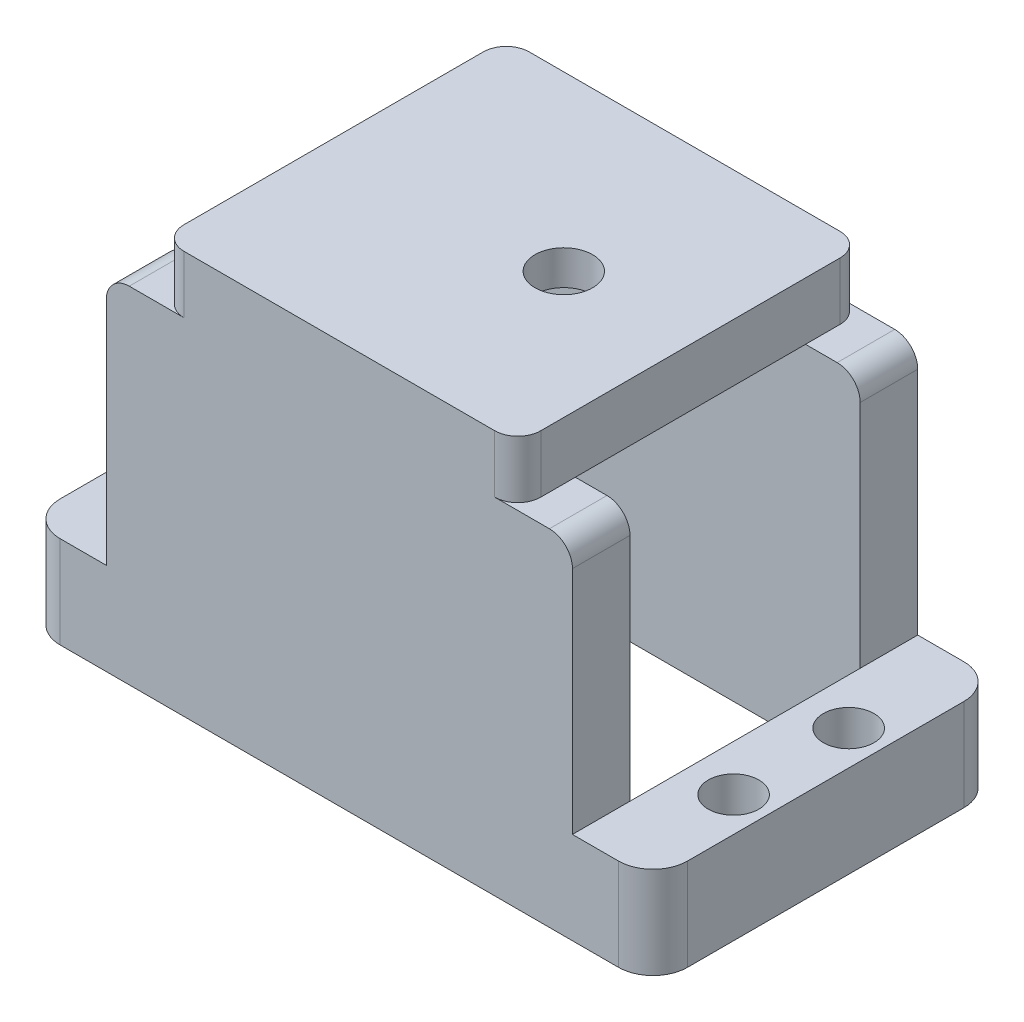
ISO-10303-21;
HEADER;
FILE_DESCRIPTION(('STEP AP214'),'2;1');
FILE_NAME('part.step','',(''),(''),'','','');
FILE_SCHEMA(('AUTOMOTIVE_DESIGN { 1 0 10303 214 1 1 1 1 }'));
ENDSEC;
DATA;
#1=APPLICATION_CONTEXT('core data for automotive mechanical design processes');
#2=APPLICATION_PROTOCOL_DEFINITION('international standard','automotive_design',2000,#1);
#3=PRODUCT_CONTEXT('',#1,'mechanical');
#4=PRODUCT('Part','Part','',(#3));
#5=PRODUCT_RELATED_PRODUCT_CATEGORY('part','',(#4));
#6=PRODUCT_DEFINITION_FORMATION('','',#4);
#7=PRODUCT_DEFINITION_CONTEXT('part definition',#1,'design');
#8=PRODUCT_DEFINITION('design','',#6,#7);
#9=PRODUCT_DEFINITION_SHAPE('','',#8);
#10=(LENGTH_UNIT() NAMED_UNIT(*) SI_UNIT(.MILLI.,.METRE.));
#11=(NAMED_UNIT(*) PLANE_ANGLE_UNIT() SI_UNIT($,.RADIAN.));
#12=(NAMED_UNIT(*) SI_UNIT($,.STERADIAN.) SOLID_ANGLE_UNIT());
#13=UNCERTAINTY_MEASURE_WITH_UNIT(LENGTH_MEASURE(1.E-05),#10,'distance_accuracy_value','');
#14=(GEOMETRIC_REPRESENTATION_CONTEXT(3) GLOBAL_UNCERTAINTY_ASSIGNED_CONTEXT((#13)) GLOBAL_UNIT_ASSIGNED_CONTEXT((#10,
#11,#12)) REPRESENTATION_CONTEXT('',''));
#15=CARTESIAN_POINT('',(0.,0.,0.));
#16=DIRECTION('',(0.,0.,1.));
#17=DIRECTION('',(1.,0.,0.));
#18=AXIS2_PLACEMENT_3D('',#15,#16,#17);
#19=CARTESIAN_POINT('',(31.75,0.,15.));
#20=DIRECTION('',(0.,1.,0.));
#21=DIRECTION('',(0.,0.,1.));
#22=AXIS2_PLACEMENT_3D('',#19,#20,#21);
#23=CYLINDRICAL_SURFACE('',#22,2.50006622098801);
#24=CARTESIAN_POINT('',(31.75,35.,15.));
#25=DIRECTION('',(0.,1.,0.));
#26=DIRECTION('',(0.,0.,1.));
#27=AXIS2_PLACEMENT_3D('',#24,#25,#26);
#28=CIRCLE('',#27,2.50006622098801);
#29=CARTESIAN_POINT('',(31.75,35.,17.500066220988));
#30=VERTEX_POINT('',#29);
#31=EDGE_CURVE('E355',#30,#30,#28,.T.);
#32=ORIENTED_EDGE('',*,*,#31,.T.);
#33=EDGE_LOOP('',(#32));
#34=FACE_BOUND('',#33,.T.);
#35=CARTESIAN_POINT('',(31.75,32.,15.));
#36=DIRECTION('',(0.,-1.,0.));
#37=DIRECTION('',(0.,0.,-1.));
#38=AXIS2_PLACEMENT_3D('',#35,#36,#37);
#39=CIRCLE('',#38,2.50006622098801);
#40=CARTESIAN_POINT('',(31.75,32.,12.499933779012));
#41=VERTEX_POINT('',#40);
#42=EDGE_CURVE('E352',#41,#41,#39,.F.);
#43=ORIENTED_EDGE('',*,*,#42,.F.);
#44=EDGE_LOOP('',(#43));
#45=FACE_BOUND('',#44,.T.);
#46=ADVANCED_FACE('F44',(#34,#45),#23,.F.);
#47=CARTESIAN_POINT('',(0.,30.,0.));
#48=DIRECTION('',(0.,1.,0.));
#49=DIRECTION('',(0.,0.,1.));
#50=AXIS2_PLACEMENT_3D('',#47,#48,#49);
#51=PLANE('',#50);
#52=DIRECTION('',(-1.,0.,0.));
#53=VECTOR('',#52,1.);
#54=CARTESIAN_POINT('',(7.,30.,25.));
#55=LINE('',#54,#53);
#56=CARTESIAN_POINT('',(11.75,30.,25.));
#57=VERTEX_POINT('',#56);
#58=CARTESIAN_POINT('',(9.,30.,25.));
#59=VERTEX_POINT('',#58);
#60=EDGE_CURVE('E267',#57,#59,#55,.T.);
#61=ORIENTED_EDGE('',*,*,#60,.T.);
#62=DIRECTION('',(0.,0.,1.));
#63=VECTOR('',#62,1.);
#64=CARTESIAN_POINT('',(9.,30.,30.));
#65=LINE('',#64,#63);
#66=CARTESIAN_POINT('',(9.,30.,30.));
#67=VERTEX_POINT('',#66);
#68=EDGE_CURVE('E480',#59,#67,#65,.T.);
#69=ORIENTED_EDGE('',*,*,#68,.T.);
#70=DIRECTION('',(1.,0.,0.));
#71=VECTOR('',#70,1.);
#72=CARTESIAN_POINT('',(0.,30.,30.));
#73=LINE('',#72,#71);
#74=CARTESIAN_POINT('',(13.75,30.,30.));
#75=VERTEX_POINT('',#74);
#76=EDGE_CURVE('E319',#67,#75,#73,.T.);
#77=ORIENTED_EDGE('',*,*,#76,.T.);
#78=CARTESIAN_POINT('',(13.75,30.,28.));
#79=DIRECTION('',(0.,1.,0.));
#80=DIRECTION('',(0.,0.,1.));
#81=AXIS2_PLACEMENT_3D('',#78,#79,#80);
#82=CIRCLE('',#81,2.);
#83=CARTESIAN_POINT('',(11.75,30.,28.));
#84=VERTEX_POINT('',#83);
#85=EDGE_CURVE('E11',#75,#84,#82,.F.);
#86=ORIENTED_EDGE('',*,*,#85,.T.);
#87=DIRECTION('',(0.,0.,1.));
#88=VECTOR('',#87,1.);
#89=CARTESIAN_POINT('',(11.75,30.,0.));
#90=LINE('',#89,#88);
#91=EDGE_CURVE('E302',#57,#84,#90,.T.);
#92=ORIENTED_EDGE('',*,*,#91,.F.);
#93=EDGE_LOOP('',(#61,#69,#77,#86,#92));
#94=FACE_BOUND('',#93,.T.);
#95=ADVANCED_FACE('F569',(#94),#51,.T.);
#96=DIRECTION('',(-1.,0.,0.));
#97=VECTOR('',#96,1.);
#98=CARTESIAN_POINT('',(0.,30.,0.));
#99=LINE('',#98,#97);
#100=CARTESIAN_POINT('',(13.75,30.,0.));
#101=VERTEX_POINT('',#100);
#102=CARTESIAN_POINT('',(9.,30.,0.));
#103=VERTEX_POINT('',#102);
#104=EDGE_CURVE('E312',#101,#103,#99,.T.);
#105=ORIENTED_EDGE('',*,*,#104,.T.);
#106=DIRECTION('',(0.,0.,1.));
#107=VECTOR('',#106,1.);
#108=CARTESIAN_POINT('',(9.,30.,5.));
#109=LINE('',#108,#107);
#110=CARTESIAN_POINT('',(9.,30.,5.));
#111=VERTEX_POINT('',#110);
#112=EDGE_CURVE('E486',#103,#111,#109,.T.);
#113=ORIENTED_EDGE('',*,*,#112,.T.);
#114=DIRECTION('',(1.,0.,0.));
#115=VECTOR('',#114,1.);
#116=CARTESIAN_POINT('',(7.,30.,5.));
#117=LINE('',#116,#115);
#118=CARTESIAN_POINT('',(11.75,30.,5.));
#119=VERTEX_POINT('',#118);
#120=EDGE_CURVE('E864',#111,#119,#117,.T.);
#121=ORIENTED_EDGE('',*,*,#120,.T.);
#122=CARTESIAN_POINT('',(11.75,30.,2.));
#123=VERTEX_POINT('',#122);
#124=EDGE_CURVE('E297',#123,#119,#90,.T.);
#125=ORIENTED_EDGE('',*,*,#124,.F.);
#126=CARTESIAN_POINT('',(13.75,30.,2.));
#127=DIRECTION('',(0.,1.,0.));
#128=DIRECTION('',(0.,0.,1.));
#129=AXIS2_PLACEMENT_3D('',#126,#127,#128);
#130=CIRCLE('',#129,2.);
#131=EDGE_CURVE('E53',#123,#101,#130,.F.);
#132=ORIENTED_EDGE('',*,*,#131,.T.);
#133=EDGE_LOOP('',(#105,#113,#121,#125,#132));
#134=FACE_BOUND('',#133,.T.);
#135=ADVANCED_FACE('F503',(#134),#51,.T.);
#136=CARTESIAN_POINT('',(40.75,30.,30.));
#137=VERTEX_POINT('',#136);
#138=CARTESIAN_POINT('',(45.5,30.,30.));
#139=VERTEX_POINT('',#138);
#140=EDGE_CURVE('E340',#137,#139,#73,.T.);
#141=ORIENTED_EDGE('',*,*,#140,.T.);
#142=DIRECTION('',(0.,0.,1.));
#143=VECTOR('',#142,1.);
#144=CARTESIAN_POINT('',(45.5,30.,25.));
#145=LINE('',#144,#143);
#146=CARTESIAN_POINT('',(45.5,30.,25.));
#147=VERTEX_POINT('',#146);
#148=EDGE_CURVE('E262',#139,#147,#145,.F.);
#149=ORIENTED_EDGE('',*,*,#148,.T.);
#150=CARTESIAN_POINT('',(42.75,30.,25.));
#151=VERTEX_POINT('',#150);
#152=EDGE_CURVE('E255',#147,#151,#55,.T.);
#153=ORIENTED_EDGE('',*,*,#152,.T.);
#154=DIRECTION('',(0.,0.,-1.));
#155=VECTOR('',#154,1.);
#156=CARTESIAN_POINT('',(42.75,30.,0.));
#157=LINE('',#156,#155);
#158=CARTESIAN_POINT('',(42.75,30.,28.));
#159=VERTEX_POINT('',#158);
#160=EDGE_CURVE('E260',#159,#151,#157,.T.);
#161=ORIENTED_EDGE('',*,*,#160,.F.);
#162=CARTESIAN_POINT('',(40.75,30.,28.));
#163=DIRECTION('',(0.,1.,0.));
#164=DIRECTION('',(0.,0.,1.));
#165=AXIS2_PLACEMENT_3D('',#162,#163,#164);
#166=CIRCLE('',#165,2.);
#167=EDGE_CURVE('E493',#159,#137,#166,.F.);
#168=ORIENTED_EDGE('',*,*,#167,.T.);
#169=EDGE_LOOP('',(#141,#149,#153,#161,#168));
#170=FACE_BOUND('',#169,.T.);
#171=ADVANCED_FACE('F258',(#170),#51,.T.);
#172=CARTESIAN_POINT('',(7.,30.,0.));
#173=DIRECTION('',(1.,0.,0.));
#174=DIRECTION('',(0.,1.,0.));
#175=AXIS2_PLACEMENT_3D('',#172,#173,#174);
#176=PLANE('',#175);
#177=DIRECTION('',(0.,1.,0.));
#178=VECTOR('',#177,1.);
#179=CARTESIAN_POINT('',(7.,30.,30.));
#180=LINE('',#179,#178);
#181=CARTESIAN_POINT('',(7.,8.,30.));
#182=VERTEX_POINT('',#181);
#183=CARTESIAN_POINT('',(7.,28.,30.));
#184=VERTEX_POINT('',#183);
#185=EDGE_CURVE('E765',#182,#184,#180,.T.);
#186=ORIENTED_EDGE('',*,*,#185,.T.);
#187=DIRECTION('',(0.,0.,1.));
#188=VECTOR('',#187,1.);
#189=CARTESIAN_POINT('',(7.,28.,25.));
#190=LINE('',#189,#188);
#191=CARTESIAN_POINT('',(7.,28.,25.));
#192=VERTEX_POINT('',#191);
#193=EDGE_CURVE('E68',#184,#192,#190,.F.);
#194=ORIENTED_EDGE('',*,*,#193,.T.);
#195=DIRECTION('',(0.,-1.,0.));
#196=VECTOR('',#195,1.);
#197=CARTESIAN_POINT('',(7.,30.,25.));
#198=LINE('',#197,#196);
#199=CARTESIAN_POINT('',(7.,8.,25.));
#200=VERTEX_POINT('',#199);
#201=EDGE_CURVE('E720',#192,#200,#198,.T.);
#202=ORIENTED_EDGE('',*,*,#201,.T.);
#203=DIRECTION('',(0.,0.,1.));
#204=VECTOR('',#203,1.);
#205=CARTESIAN_POINT('',(7.,8.,0.));
#206=LINE('',#205,#204);
#207=EDGE_CURVE('E764',#200,#182,#206,.T.);
#208=ORIENTED_EDGE('',*,*,#207,.T.);
#209=EDGE_LOOP('',(#186,#194,#202,#208));
#210=FACE_BOUND('',#209,.T.);
#211=ADVANCED_FACE('F618',(#210),#176,.F.);
#212=CARTESIAN_POINT('',(47.5,30.,0.));
#213=DIRECTION('',(-1.,0.,0.));
#214=DIRECTION('',(0.,0.,1.));
#215=AXIS2_PLACEMENT_3D('',#212,#213,#214);
#216=PLANE('',#215);
#217=DIRECTION('',(0.,-1.,0.));
#218=VECTOR('',#217,1.);
#219=CARTESIAN_POINT('',(47.5,30.,25.));
#220=LINE('',#219,#218);
#221=CARTESIAN_POINT('',(47.5,28.,25.));
#222=VERTEX_POINT('',#221);
#223=CARTESIAN_POINT('',(47.5,8.,25.));
#224=VERTEX_POINT('',#223);
#225=EDGE_CURVE('E706',#222,#224,#220,.T.);
#226=ORIENTED_EDGE('',*,*,#225,.F.);
#227=DIRECTION('',(0.,0.,1.));
#228=VECTOR('',#227,1.);
#229=CARTESIAN_POINT('',(47.5,28.,30.));
#230=LINE('',#229,#228);
#231=CARTESIAN_POINT('',(47.5,28.,30.));
#232=VERTEX_POINT('',#231);
#233=EDGE_CURVE('E469',#222,#232,#230,.T.);
#234=ORIENTED_EDGE('',*,*,#233,.T.);
#235=DIRECTION('',(0.,-1.,0.));
#236=VECTOR('',#235,1.);
#237=CARTESIAN_POINT('',(47.5,30.,30.));
#238=LINE('',#237,#236);
#239=CARTESIAN_POINT('',(47.5,8.,30.));
#240=VERTEX_POINT('',#239);
#241=EDGE_CURVE('E739',#232,#240,#238,.T.);
#242=ORIENTED_EDGE('',*,*,#241,.T.);
#243=DIRECTION('',(0.,0.,1.));
#244=VECTOR('',#243,1.);
#245=CARTESIAN_POINT('',(47.5,8.,0.));
#246=LINE('',#245,#244);
#247=EDGE_CURVE('E712',#224,#240,#246,.T.);
#248=ORIENTED_EDGE('',*,*,#247,.F.);
#249=EDGE_LOOP('',(#226,#234,#242,#248));
#250=FACE_BOUND('',#249,.T.);
#251=ADVANCED_FACE('F609',(#250),#216,.F.);
#252=CARTESIAN_POINT('',(42.75,30.,5.));
#253=VERTEX_POINT('',#252);
#254=CARTESIAN_POINT('',(45.5,30.,5.));
#255=VERTEX_POINT('',#254);
#256=EDGE_CURVE('E861',#253,#255,#117,.T.);
#257=ORIENTED_EDGE('',*,*,#256,.T.);
#258=DIRECTION('',(0.,0.,1.));
#259=VECTOR('',#258,1.);
#260=CARTESIAN_POINT('',(45.5,30.,0.));
#261=LINE('',#260,#259);
#262=CARTESIAN_POINT('',(45.5,30.,0.));
#263=VERTEX_POINT('',#262);
#264=EDGE_CURVE('E466',#255,#263,#261,.F.);
#265=ORIENTED_EDGE('',*,*,#264,.T.);
#266=CARTESIAN_POINT('',(40.75,30.,0.));
#267=VERTEX_POINT('',#266);
#268=EDGE_CURVE('E306',#263,#267,#99,.T.);
#269=ORIENTED_EDGE('',*,*,#268,.T.);
#270=CARTESIAN_POINT('',(40.75,30.,2.));
#271=DIRECTION('',(0.,1.,0.));
#272=DIRECTION('',(0.,0.,1.));
#273=AXIS2_PLACEMENT_3D('',#270,#271,#272);
#274=CIRCLE('',#273,2.);
#275=CARTESIAN_POINT('',(42.75,30.,2.));
#276=VERTEX_POINT('',#275);
#277=EDGE_CURVE('E496',#267,#276,#274,.F.);
#278=ORIENTED_EDGE('',*,*,#277,.T.);
#279=EDGE_CURVE('E283',#253,#276,#157,.T.);
#280=ORIENTED_EDGE('',*,*,#279,.F.);
#281=EDGE_LOOP('',(#257,#265,#269,#278,#280));
#282=FACE_BOUND('',#281,.T.);
#283=ADVANCED_FACE('F578',(#282),#51,.T.);
#284=CARTESIAN_POINT('',(0.,0.,0.));
#285=DIRECTION('',(0.,1.,0.));
#286=DIRECTION('',(0.,0.,1.));
#287=AXIS2_PLACEMENT_3D('',#284,#285,#286);
#288=PLANE('',#287);
#289=DIRECTION('',(1.,0.,0.));
#290=VECTOR('',#289,1.);
#291=CARTESIAN_POINT('',(7.,0.,5.));
#292=LINE('',#291,#290);
#293=CARTESIAN_POINT('',(7.,0.,5.));
#294=VERTEX_POINT('',#293);
#295=CARTESIAN_POINT('',(47.5,0.,5.));
#296=VERTEX_POINT('',#295);
#297=EDGE_CURVE('E858',#294,#296,#292,.T.);
#298=ORIENTED_EDGE('',*,*,#297,.F.);
#299=DIRECTION('',(0.,0.,-1.));
#300=VECTOR('',#299,1.);
#301=CARTESIAN_POINT('',(7.,0.,25.));
#302=LINE('',#301,#300);
#303=CARTESIAN_POINT('',(7.,0.,25.));
#304=VERTEX_POINT('',#303);
#305=EDGE_CURVE('E290',#304,#294,#302,.T.);
#306=ORIENTED_EDGE('',*,*,#305,.F.);
#307=DIRECTION('',(-1.,0.,0.));
#308=VECTOR('',#307,1.);
#309=CARTESIAN_POINT('',(7.,0.,25.));
#310=LINE('',#309,#308);
#311=CARTESIAN_POINT('',(47.5,0.,25.));
#312=VERTEX_POINT('',#311);
#313=EDGE_CURVE('E823',#312,#304,#310,.T.);
#314=ORIENTED_EDGE('',*,*,#313,.F.);
#315=DIRECTION('',(0.,0.,1.));
#316=VECTOR('',#315,1.);
#317=CARTESIAN_POINT('',(47.5,0.,25.));
#318=LINE('',#317,#316);
#319=EDGE_CURVE('E855',#296,#312,#318,.T.);
#320=ORIENTED_EDGE('',*,*,#319,.F.);
#321=EDGE_LOOP('',(#298,#306,#314,#320));
#322=FACE_BOUND('',#321,.T.);
#323=DIRECTION('',(0.,0.,1.));
#324=VECTOR('',#323,1.);
#325=CARTESIAN_POINT('',(0.,0.,0.));
#326=LINE('',#325,#324);
#327=CARTESIAN_POINT('',(0.,0.,3.));
#328=VERTEX_POINT('',#327);
#329=CARTESIAN_POINT('',(0.,0.,27.));
#330=VERTEX_POINT('',#329);
#331=EDGE_CURVE('E323',#328,#330,#326,.T.);
#332=ORIENTED_EDGE('',*,*,#331,.F.);
#333=CARTESIAN_POINT('',(3.,0.,3.));
#334=DIRECTION('',(0.,1.,0.));
#335=DIRECTION('',(0.,0.,1.));
#336=AXIS2_PLACEMENT_3D('',#333,#334,#335);
#337=CIRCLE('',#336,3.);
#338=CARTESIAN_POINT('',(3.,0.,0.));
#339=VERTEX_POINT('',#338);
#340=EDGE_CURVE('E370',#328,#339,#337,.F.);
#341=ORIENTED_EDGE('',*,*,#340,.T.);
#342=DIRECTION('',(-1.,0.,0.));
#343=VECTOR('',#342,1.);
#344=CARTESIAN_POINT('',(0.,0.,0.));
#345=LINE('',#344,#343);
#346=CARTESIAN_POINT('',(51.5,0.,0.));
#347=VERTEX_POINT('',#346);
#348=EDGE_CURVE('E336',#347,#339,#345,.T.);
#349=ORIENTED_EDGE('',*,*,#348,.F.);
#350=CARTESIAN_POINT('',(51.5,0.,3.));
#351=DIRECTION('',(0.,1.,0.));
#352=DIRECTION('',(0.,0.,1.));
#353=AXIS2_PLACEMENT_3D('',#350,#351,#352);
#354=CIRCLE('',#353,3.);
#355=CARTESIAN_POINT('',(54.5,0.,3.));
#356=VERTEX_POINT('',#355);
#357=EDGE_CURVE('E364',#347,#356,#354,.F.);
#358=ORIENTED_EDGE('',*,*,#357,.T.);
#359=DIRECTION('',(0.,0.,-1.));
#360=VECTOR('',#359,1.);
#361=CARTESIAN_POINT('',(54.5,0.,0.));
#362=LINE('',#361,#360);
#363=CARTESIAN_POINT('',(54.5,0.,27.));
#364=VERTEX_POINT('',#363);
#365=EDGE_CURVE('E332',#364,#356,#362,.T.);
#366=ORIENTED_EDGE('',*,*,#365,.F.);
#367=CARTESIAN_POINT('',(51.5,0.,27.));
#368=DIRECTION('',(0.,1.,0.));
#369=DIRECTION('',(0.,0.,1.));
#370=AXIS2_PLACEMENT_3D('',#367,#368,#369);
#371=CIRCLE('',#370,3.);
#372=CARTESIAN_POINT('',(51.5,0.,30.));
#373=VERTEX_POINT('',#372);
#374=EDGE_CURVE('E361',#364,#373,#371,.F.);
#375=ORIENTED_EDGE('',*,*,#374,.T.);
#376=DIRECTION('',(1.,0.,0.));
#377=VECTOR('',#376,1.);
#378=CARTESIAN_POINT('',(0.,0.,30.));
#379=LINE('',#378,#377);
#380=CARTESIAN_POINT('',(3.,0.,30.));
#381=VERTEX_POINT('',#380);
#382=EDGE_CURVE('E327',#381,#373,#379,.T.);
#383=ORIENTED_EDGE('',*,*,#382,.F.);
#384=CARTESIAN_POINT('',(3.,0.,27.));
#385=DIRECTION('',(0.,1.,0.));
#386=DIRECTION('',(0.,0.,1.));
#387=AXIS2_PLACEMENT_3D('',#384,#385,#386);
#388=CIRCLE('',#387,3.);
#389=EDGE_CURVE('E367',#381,#330,#388,.F.);
#390=ORIENTED_EDGE('',*,*,#389,.T.);
#391=EDGE_LOOP('',(#332,#341,#349,#358,#366,#375,#383,#390));
#392=FACE_BOUND('',#391,.T.);
#393=CARTESIAN_POINT('',(51.5,0.,10.));
#394=DIRECTION('',(0.,1.,0.));
#395=DIRECTION('',(0.,0.,1.));
#396=AXIS2_PLACEMENT_3D('',#393,#394,#395);
#397=CIRCLE('',#396,2.2);
#398=CARTESIAN_POINT('',(51.5,0.,12.2));
#399=VERTEX_POINT('',#398);
#400=EDGE_CURVE('E328',#399,#399,#397,.T.);
#401=ORIENTED_EDGE('',*,*,#400,.T.);
#402=EDGE_LOOP('',(#401));
#403=FACE_BOUND('',#402,.T.);
#404=CARTESIAN_POINT('',(51.5,0.,20.));
#405=DIRECTION('',(0.,1.,0.));
#406=DIRECTION('',(0.,0.,-1.));
#407=AXIS2_PLACEMENT_3D('',#404,#405,#406);
#408=CIRCLE('',#407,2.2);
#409=CARTESIAN_POINT('',(51.5,0.,17.8));
#410=VERTEX_POINT('',#409);
#411=EDGE_CURVE('E790',#410,#410,#408,.T.);
#412=ORIENTED_EDGE('',*,*,#411,.T.);
#413=EDGE_LOOP('',(#412));
#414=FACE_BOUND('',#413,.T.);
#415=CARTESIAN_POINT('',(3.00000000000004,0.,20.));
#416=DIRECTION('',(0.,1.,0.));
#417=DIRECTION('',(0.,0.,1.));
#418=AXIS2_PLACEMENT_3D('',#415,#416,#417);
#419=CIRCLE('',#418,2.2);
#420=CARTESIAN_POINT('',(3.00000000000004,0.,22.2));
#421=VERTEX_POINT('',#420);
#422=EDGE_CURVE('E786',#421,#421,#419,.T.);
#423=ORIENTED_EDGE('',*,*,#422,.T.);
#424=EDGE_LOOP('',(#423));
#425=FACE_BOUND('',#424,.T.);
#426=CARTESIAN_POINT('',(3.00000000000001,0.,10.));
#427=DIRECTION('',(0.,1.,0.));
#428=DIRECTION('',(0.,0.,-1.));
#429=AXIS2_PLACEMENT_3D('',#426,#427,#428);
#430=CIRCLE('',#429,2.2);
#431=CARTESIAN_POINT('',(3.00000000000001,0.,7.80000000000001));
#432=VERTEX_POINT('',#431);
#433=EDGE_CURVE('E782',#432,#432,#430,.T.);
#434=ORIENTED_EDGE('',*,*,#433,.T.);
#435=EDGE_LOOP('',(#434));
#436=FACE_BOUND('',#435,.T.);
#437=ADVANCED_FACE('F635',(#322,#392,#403,#414,#425,#436),#288,.F.);
#438=CARTESIAN_POINT('',(0.,30.,0.));
#439=DIRECTION('',(1.,0.,0.));
#440=DIRECTION('',(0.,0.,-1.));
#441=AXIS2_PLACEMENT_3D('',#438,#439,#440);
#442=PLANE('',#441);
#443=DIRECTION('',(0.,0.,1.));
#444=VECTOR('',#443,1.);
#445=CARTESIAN_POINT('',(0.,8.,0.));
#446=LINE('',#445,#444);
#447=CARTESIAN_POINT('',(0.,8.,3.));
#448=VERTEX_POINT('',#447);
#449=CARTESIAN_POINT('',(0.,8.,27.));
#450=VERTEX_POINT('',#449);
#451=EDGE_CURVE('E754',#448,#450,#446,.T.);
#452=ORIENTED_EDGE('',*,*,#451,.F.);
#453=DIRECTION('',(0.,-1.,0.));
#454=VECTOR('',#453,1.);
#455=CARTESIAN_POINT('',(0.,30.,3.));
#456=LINE('',#455,#454);
#457=EDGE_CURVE('E310',#448,#328,#456,.T.);
#458=ORIENTED_EDGE('',*,*,#457,.T.);
#459=ORIENTED_EDGE('',*,*,#331,.T.);
#460=DIRECTION('',(0.,-1.,0.));
#461=VECTOR('',#460,1.);
#462=CARTESIAN_POINT('',(0.,30.,27.));
#463=LINE('',#462,#461);
#464=EDGE_CURVE('E305',#330,#450,#463,.F.);
#465=ORIENTED_EDGE('',*,*,#464,.T.);
#466=EDGE_LOOP('',(#452,#458,#459,#465));
#467=FACE_BOUND('',#466,.T.);
#468=ADVANCED_FACE('F638',(#467),#442,.F.);
#469=CARTESIAN_POINT('',(0.,30.,30.));
#470=DIRECTION('',(0.,0.,-1.));
#471=DIRECTION('',(-1.,0.,0.));
#472=AXIS2_PLACEMENT_3D('',#469,#470,#471);
#473=PLANE('',#472);
#474=ORIENTED_EDGE('',*,*,#140,.F.);
#475=DIRECTION('',(0.,-1.,0.));
#476=VECTOR('',#475,1.);
#477=CARTESIAN_POINT('',(40.75,30.,30.));
#478=LINE('',#477,#476);
#479=CARTESIAN_POINT('',(40.75,35.,30.));
#480=VERTEX_POINT('',#479);
#481=EDGE_CURVE('E421',#137,#480,#478,.F.);
#482=ORIENTED_EDGE('',*,*,#481,.T.);
#483=DIRECTION('',(1.,0.,0.));
#484=VECTOR('',#483,1.);
#485=CARTESIAN_POINT('',(11.75,35.,30.));
#486=LINE('',#485,#484);
#487=CARTESIAN_POINT('',(13.75,35.,30.));
#488=VERTEX_POINT('',#487);
#489=EDGE_CURVE('E525',#488,#480,#486,.T.);
#490=ORIENTED_EDGE('',*,*,#489,.F.);
#491=DIRECTION('',(0.,-1.,0.));
#492=VECTOR('',#491,1.);
#493=CARTESIAN_POINT('',(13.75,30.,30.));
#494=LINE('',#493,#492);
#495=EDGE_CURVE('E417',#488,#75,#494,.T.);
#496=ORIENTED_EDGE('',*,*,#495,.T.);
#497=ORIENTED_EDGE('',*,*,#76,.F.);
#498=CARTESIAN_POINT('',(9.,28.,30.));
#499=DIRECTION('',(0.,0.,-1.));
#500=DIRECTION('',(-1.,0.,0.));
#501=AXIS2_PLACEMENT_3D('',#498,#499,#500);
#502=CIRCLE('',#501,2.);
#503=EDGE_CURVE('E411',#67,#184,#502,.F.);
#504=ORIENTED_EDGE('',*,*,#503,.T.);
#505=ORIENTED_EDGE('',*,*,#185,.F.);
#506=DIRECTION('',(1.,0.,0.));
#507=VECTOR('',#506,1.);
#508=CARTESIAN_POINT('',(0.,8.,30.));
#509=LINE('',#508,#507);
#510=CARTESIAN_POINT('',(3.,8.,30.));
#511=VERTEX_POINT('',#510);
#512=EDGE_CURVE('E742',#511,#182,#509,.T.);
#513=ORIENTED_EDGE('',*,*,#512,.F.);
#514=DIRECTION('',(0.,-1.,0.));
#515=VECTOR('',#514,1.);
#516=CARTESIAN_POINT('',(3.,30.,30.));
#517=LINE('',#516,#515);
#518=EDGE_CURVE('E389',#511,#381,#517,.T.);
#519=ORIENTED_EDGE('',*,*,#518,.T.);
#520=ORIENTED_EDGE('',*,*,#382,.T.);
#521=DIRECTION('',(0.,-1.,0.));
#522=VECTOR('',#521,1.);
#523=CARTESIAN_POINT('',(51.5,30.,30.));
#524=LINE('',#523,#522);
#525=CARTESIAN_POINT('',(51.5,8.,30.));
#526=VERTEX_POINT('',#525);
#527=EDGE_CURVE('E386',#373,#526,#524,.F.);
#528=ORIENTED_EDGE('',*,*,#527,.T.);
#529=DIRECTION('',(1.,0.,0.));
#530=VECTOR('',#529,1.);
#531=CARTESIAN_POINT('',(54.5,8.,30.));
#532=LINE('',#531,#530);
#533=EDGE_CURVE('E735',#240,#526,#532,.T.);
#534=ORIENTED_EDGE('',*,*,#533,.F.);
#535=ORIENTED_EDGE('',*,*,#241,.F.);
#536=CARTESIAN_POINT('',(45.5,28.,30.));
#537=DIRECTION('',(0.,0.,-1.));
#538=DIRECTION('',(-1.,0.,0.));
#539=AXIS2_PLACEMENT_3D('',#536,#537,#538);
#540=CIRCLE('',#539,2.);
#541=EDGE_CURVE('E414',#232,#139,#540,.F.);
#542=ORIENTED_EDGE('',*,*,#541,.T.);
#543=EDGE_LOOP('',(#474,#482,#490,#496,#497,#504,#505,#513,#519,#520,#528,#534,#535,#542));
#544=FACE_BOUND('',#543,.T.);
#545=ADVANCED_FACE('F645',(#544),#473,.F.);
#546=CARTESIAN_POINT('',(54.5,30.,0.));
#547=DIRECTION('',(-1.,0.,0.));
#548=DIRECTION('',(0.,0.,1.));
#549=AXIS2_PLACEMENT_3D('',#546,#547,#548);
#550=PLANE('',#549);
#551=ORIENTED_EDGE('',*,*,#365,.T.);
#552=DIRECTION('',(0.,-1.,0.));
#553=VECTOR('',#552,1.);
#554=CARTESIAN_POINT('',(54.5,30.,3.));
#555=LINE('',#554,#553);
#556=CARTESIAN_POINT('',(54.5,8.,3.));
#557=VERTEX_POINT('',#556);
#558=EDGE_CURVE('E397',#356,#557,#555,.F.);
#559=ORIENTED_EDGE('',*,*,#558,.T.);
#560=DIRECTION('',(0.,0.,1.));
#561=VECTOR('',#560,1.);
#562=CARTESIAN_POINT('',(54.5,8.,0.));
#563=LINE('',#562,#561);
#564=CARTESIAN_POINT('',(54.5,8.,27.));
#565=VERTEX_POINT('',#564);
#566=EDGE_CURVE('E346',#557,#565,#563,.T.);
#567=ORIENTED_EDGE('',*,*,#566,.T.);
#568=DIRECTION('',(0.,-1.,0.));
#569=VECTOR('',#568,1.);
#570=CARTESIAN_POINT('',(54.5,30.,27.));
#571=LINE('',#570,#569);
#572=EDGE_CURVE('E393',#565,#364,#571,.T.);
#573=ORIENTED_EDGE('',*,*,#572,.T.);
#574=EDGE_LOOP('',(#551,#559,#567,#573));
#575=FACE_BOUND('',#574,.T.);
#576=ADVANCED_FACE('F642',(#575),#550,.F.);
#577=CARTESIAN_POINT('',(0.,30.,0.));
#578=DIRECTION('',(0.,0.,1.));
#579=DIRECTION('',(1.,0.,0.));
#580=AXIS2_PLACEMENT_3D('',#577,#578,#579);
#581=PLANE('',#580);
#582=DIRECTION('',(-1.,0.,0.));
#583=VECTOR('',#582,1.);
#584=CARTESIAN_POINT('',(11.75,35.,0.));
#585=LINE('',#584,#583);
#586=CARTESIAN_POINT('',(40.75,35.,0.));
#587=VERTEX_POINT('',#586);
#588=CARTESIAN_POINT('',(13.75,35.,0.));
#589=VERTEX_POINT('',#588);
#590=EDGE_CURVE('E291',#587,#589,#585,.T.);
#591=ORIENTED_EDGE('',*,*,#590,.F.);
#592=DIRECTION('',(0.,-1.,0.));
#593=VECTOR('',#592,1.);
#594=CARTESIAN_POINT('',(40.75,30.,0.));
#595=LINE('',#594,#593);
#596=EDGE_CURVE('E445',#587,#267,#595,.T.);
#597=ORIENTED_EDGE('',*,*,#596,.T.);
#598=ORIENTED_EDGE('',*,*,#268,.F.);
#599=CARTESIAN_POINT('',(45.5,28.,0.));
#600=DIRECTION('',(0.,0.,1.));
#601=DIRECTION('',(1.,0.,0.));
#602=AXIS2_PLACEMENT_3D('',#599,#600,#601);
#603=CIRCLE('',#602,2.);
#604=CARTESIAN_POINT('',(47.5,28.,0.));
#605=VERTEX_POINT('',#604);
#606=EDGE_CURVE('E439',#263,#605,#603,.F.);
#607=ORIENTED_EDGE('',*,*,#606,.T.);
#608=DIRECTION('',(0.,-1.,0.));
#609=VECTOR('',#608,1.);
#610=CARTESIAN_POINT('',(47.5,30.,0.));
#611=LINE('',#610,#609);
#612=CARTESIAN_POINT('',(47.5,8.,0.));
#613=VERTEX_POINT('',#612);
#614=EDGE_CURVE('E731',#605,#613,#611,.T.);
#615=ORIENTED_EDGE('',*,*,#614,.T.);
#616=DIRECTION('',(1.,0.,0.));
#617=VECTOR('',#616,1.);
#618=CARTESIAN_POINT('',(54.5,8.,0.));
#619=LINE('',#618,#617);
#620=CARTESIAN_POINT('',(51.5,8.,0.));
#621=VERTEX_POINT('',#620);
#622=EDGE_CURVE('E734',#613,#621,#619,.T.);
#623=ORIENTED_EDGE('',*,*,#622,.T.);
#624=DIRECTION('',(0.,-1.,0.));
#625=VECTOR('',#624,1.);
#626=CARTESIAN_POINT('',(51.5,30.,0.));
#627=LINE('',#626,#625);
#628=EDGE_CURVE('E373',#621,#347,#627,.T.);
#629=ORIENTED_EDGE('',*,*,#628,.T.);
#630=ORIENTED_EDGE('',*,*,#348,.T.);
#631=DIRECTION('',(0.,-1.,0.));
#632=VECTOR('',#631,1.);
#633=CARTESIAN_POINT('',(3.,30.,0.));
#634=LINE('',#633,#632);
#635=CARTESIAN_POINT('',(3.,8.,0.));
#636=VERTEX_POINT('',#635);
#637=EDGE_CURVE('E377',#339,#636,#634,.F.);
#638=ORIENTED_EDGE('',*,*,#637,.T.);
#639=DIRECTION('',(1.,0.,0.));
#640=VECTOR('',#639,1.);
#641=CARTESIAN_POINT('',(0.,8.,0.));
#642=LINE('',#641,#640);
#643=CARTESIAN_POINT('',(7.,8.,0.));
#644=VERTEX_POINT('',#643);
#645=EDGE_CURVE('E768',#636,#644,#642,.T.);
#646=ORIENTED_EDGE('',*,*,#645,.T.);
#647=DIRECTION('',(0.,1.,0.));
#648=VECTOR('',#647,1.);
#649=CARTESIAN_POINT('',(7.,30.,0.));
#650=LINE('',#649,#648);
#651=CARTESIAN_POINT('',(7.,28.,0.));
#652=VERTEX_POINT('',#651);
#653=EDGE_CURVE('E758',#644,#652,#650,.T.);
#654=ORIENTED_EDGE('',*,*,#653,.T.);
#655=CARTESIAN_POINT('',(9.,28.,0.));
#656=DIRECTION('',(0.,0.,1.));
#657=DIRECTION('',(1.,0.,0.));
#658=AXIS2_PLACEMENT_3D('',#655,#656,#657);
#659=CIRCLE('',#658,2.);
#660=EDGE_CURVE('E436',#652,#103,#659,.F.);
#661=ORIENTED_EDGE('',*,*,#660,.T.);
#662=ORIENTED_EDGE('',*,*,#104,.F.);
#663=DIRECTION('',(0.,-1.,0.));
#664=VECTOR('',#663,1.);
#665=CARTESIAN_POINT('',(13.75,30.,0.));
#666=LINE('',#665,#664);
#667=EDGE_CURVE('E442',#101,#589,#666,.F.);
#668=ORIENTED_EDGE('',*,*,#667,.T.);
#669=EDGE_LOOP('',(#591,#597,#598,#607,#615,#623,#629,#630,#638,#646,#654,#661,#662,#668));
#670=FACE_BOUND('',#669,.T.);
#671=ADVANCED_FACE('F512',(#670),#581,.F.);
#672=CARTESIAN_POINT('',(51.5,30.,10.));
#673=DIRECTION('',(0.,-1.,0.));
#674=DIRECTION('',(0.,0.,-1.));
#675=AXIS2_PLACEMENT_3D('',#672,#673,#674);
#676=CYLINDRICAL_SURFACE('',#675,2.2);
#677=CARTESIAN_POINT('',(51.5,8.,10.));
#678=DIRECTION('',(0.,-1.,0.));
#679=DIRECTION('',(0.,0.,-1.));
#680=AXIS2_PLACEMENT_3D('',#677,#678,#679);
#681=CIRCLE('',#680,2.2);
#682=CARTESIAN_POINT('',(51.5,8.,7.8));
#683=VERTEX_POINT('',#682);
#684=EDGE_CURVE('E351',#683,#683,#681,.T.);
#685=ORIENTED_EDGE('',*,*,#684,.F.);
#686=EDGE_LOOP('',(#685));
#687=FACE_BOUND('',#686,.T.);
#688=ORIENTED_EDGE('',*,*,#400,.F.);
#689=EDGE_LOOP('',(#688));
#690=FACE_BOUND('',#689,.T.);
#691=ADVANCED_FACE('F629',(#687,#690),#676,.F.);
#692=CARTESIAN_POINT('',(51.5,30.,20.));
#693=DIRECTION('',(0.,-1.,0.));
#694=DIRECTION('',(0.,0.,-1.));
#695=AXIS2_PLACEMENT_3D('',#692,#693,#694);
#696=CYLINDRICAL_SURFACE('',#695,2.2);
#697=CARTESIAN_POINT('',(51.5,8.,20.));
#698=DIRECTION('',(0.,-1.,0.));
#699=DIRECTION('',(0.,0.,-1.));
#700=AXIS2_PLACEMENT_3D('',#697,#698,#699);
#701=CIRCLE('',#700,2.2);
#702=CARTESIAN_POINT('',(51.5,8.,17.8));
#703=VERTEX_POINT('',#702);
#704=EDGE_CURVE('E347',#703,#703,#701,.T.);
#705=ORIENTED_EDGE('',*,*,#704,.F.);
#706=EDGE_LOOP('',(#705));
#707=FACE_BOUND('',#706,.T.);
#708=ORIENTED_EDGE('',*,*,#411,.F.);
#709=EDGE_LOOP('',(#708));
#710=FACE_BOUND('',#709,.T.);
#711=ADVANCED_FACE('F625',(#707,#710),#696,.F.);
#712=CARTESIAN_POINT('',(3.00000000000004,30.,20.));
#713=DIRECTION('',(0.,-1.,0.));
#714=DIRECTION('',(0.,0.,-1.));
#715=AXIS2_PLACEMENT_3D('',#712,#713,#714);
#716=CYLINDRICAL_SURFACE('',#715,2.2);
#717=CARTESIAN_POINT('',(3.00000000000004,8.,20.));
#718=DIRECTION('',(0.,-1.,0.));
#719=DIRECTION('',(0.,0.,-1.));
#720=AXIS2_PLACEMENT_3D('',#717,#718,#719);
#721=CIRCLE('',#720,2.2);
#722=CARTESIAN_POINT('',(3.00000000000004,8.,17.8));
#723=VERTEX_POINT('',#722);
#724=EDGE_CURVE('E345',#723,#723,#721,.T.);
#725=ORIENTED_EDGE('',*,*,#724,.F.);
#726=EDGE_LOOP('',(#725));
#727=FACE_BOUND('',#726,.T.);
#728=ORIENTED_EDGE('',*,*,#422,.F.);
#729=EDGE_LOOP('',(#728));
#730=FACE_BOUND('',#729,.T.);
#731=ADVANCED_FACE('F621',(#727,#730),#716,.F.);
#732=CARTESIAN_POINT('',(3.00000000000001,30.,10.));
#733=DIRECTION('',(0.,-1.,0.));
#734=DIRECTION('',(0.,0.,-1.));
#735=AXIS2_PLACEMENT_3D('',#732,#733,#734);
#736=CYLINDRICAL_SURFACE('',#735,2.2);
#737=CARTESIAN_POINT('',(3.00000000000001,8.,10.));
#738=DIRECTION('',(0.,-1.,0.));
#739=DIRECTION('',(0.,0.,-1.));
#740=AXIS2_PLACEMENT_3D('',#737,#738,#739);
#741=CIRCLE('',#740,2.2);
#742=CARTESIAN_POINT('',(3.00000000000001,8.,7.80000000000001));
#743=VERTEX_POINT('',#742);
#744=EDGE_CURVE('E341',#743,#743,#741,.T.);
#745=ORIENTED_EDGE('',*,*,#744,.F.);
#746=EDGE_LOOP('',(#745));
#747=FACE_BOUND('',#746,.T.);
#748=ORIENTED_EDGE('',*,*,#433,.F.);
#749=EDGE_LOOP('',(#748));
#750=FACE_BOUND('',#749,.T.);
#751=ADVANCED_FACE('F616',(#747,#750),#736,.F.);
#752=DIRECTION('',(0.,-1.,0.));
#753=VECTOR('',#752,1.);
#754=CARTESIAN_POINT('',(7.,30.,5.));
#755=LINE('',#754,#753);
#756=CARTESIAN_POINT('',(7.,28.,5.));
#757=VERTEX_POINT('',#756);
#758=CARTESIAN_POINT('',(7.,8.,5.));
#759=VERTEX_POINT('',#758);
#760=EDGE_CURVE('E728',#757,#759,#755,.T.);
#761=ORIENTED_EDGE('',*,*,#760,.F.);
#762=DIRECTION('',(0.,0.,1.));
#763=VECTOR('',#762,1.);
#764=CARTESIAN_POINT('',(7.,28.,0.));
#765=LINE('',#764,#763);
#766=EDGE_CURVE('E490',#757,#652,#765,.F.);
#767=ORIENTED_EDGE('',*,*,#766,.T.);
#768=ORIENTED_EDGE('',*,*,#653,.F.);
#769=EDGE_CURVE('E759',#644,#759,#206,.T.);
#770=ORIENTED_EDGE('',*,*,#769,.T.);
#771=EDGE_LOOP('',(#761,#767,#768,#770));
#772=FACE_BOUND('',#771,.T.);
#773=ADVANCED_FACE('F612',(#772),#176,.F.);
#774=CARTESIAN_POINT('',(0.,8.,0.));
#775=DIRECTION('',(0.,-1.,0.));
#776=DIRECTION('',(0.,0.,-1.));
#777=AXIS2_PLACEMENT_3D('',#774,#775,#776);
#778=PLANE('',#777);
#779=ORIENTED_EDGE('',*,*,#724,.T.);
#780=EDGE_LOOP('',(#779));
#781=FACE_BOUND('',#780,.T.);
#782=ORIENTED_EDGE('',*,*,#744,.T.);
#783=EDGE_LOOP('',(#782));
#784=FACE_BOUND('',#783,.T.);
#785=ORIENTED_EDGE('',*,*,#645,.F.);
#786=CARTESIAN_POINT('',(3.,8.,3.));
#787=DIRECTION('',(0.,-1.,0.));
#788=DIRECTION('',(0.,0.,-1.));
#789=AXIS2_PLACEMENT_3D('',#786,#787,#788);
#790=CIRCLE('',#789,3.);
#791=EDGE_CURVE('E383',#636,#448,#790,.F.);
#792=ORIENTED_EDGE('',*,*,#791,.T.);
#793=ORIENTED_EDGE('',*,*,#451,.T.);
#794=CARTESIAN_POINT('',(3.,8.,27.));
#795=DIRECTION('',(0.,-1.,0.));
#796=DIRECTION('',(0.,0.,-1.));
#797=AXIS2_PLACEMENT_3D('',#794,#795,#796);
#798=CIRCLE('',#797,3.);
#799=EDGE_CURVE('E380',#450,#511,#798,.F.);
#800=ORIENTED_EDGE('',*,*,#799,.T.);
#801=ORIENTED_EDGE('',*,*,#512,.T.);
#802=ORIENTED_EDGE('',*,*,#207,.F.);
#803=EDGE_CURVE('E763',#759,#200,#206,.T.);
#804=ORIENTED_EDGE('',*,*,#803,.F.);
#805=ORIENTED_EDGE('',*,*,#769,.F.);
#806=EDGE_LOOP('',(#785,#792,#793,#800,#801,#802,#804,#805));
#807=FACE_BOUND('',#806,.T.);
#808=ADVANCED_FACE('F604',(#781,#784,#807),#778,.F.);
#809=CARTESIAN_POINT('',(54.5,8.,0.));
#810=DIRECTION('',(0.,-1.,0.));
#811=DIRECTION('',(0.,0.,-1.));
#812=AXIS2_PLACEMENT_3D('',#809,#810,#811);
#813=PLANE('',#812);
#814=ORIENTED_EDGE('',*,*,#684,.T.);
#815=EDGE_LOOP('',(#814));
#816=FACE_BOUND('',#815,.T.);
#817=ORIENTED_EDGE('',*,*,#704,.T.);
#818=EDGE_LOOP('',(#817));
#819=FACE_BOUND('',#818,.T.);
#820=ORIENTED_EDGE('',*,*,#566,.F.);
#821=CARTESIAN_POINT('',(51.5,8.,3.));
#822=DIRECTION('',(0.,-1.,0.));
#823=DIRECTION('',(0.,0.,-1.));
#824=AXIS2_PLACEMENT_3D('',#821,#822,#823);
#825=CIRCLE('',#824,3.);
#826=EDGE_CURVE('E403',#557,#621,#825,.F.);
#827=ORIENTED_EDGE('',*,*,#826,.T.);
#828=ORIENTED_EDGE('',*,*,#622,.F.);
#829=CARTESIAN_POINT('',(47.5,8.,5.));
#830=VERTEX_POINT('',#829);
#831=EDGE_CURVE('E749',#613,#830,#246,.T.);
#832=ORIENTED_EDGE('',*,*,#831,.T.);
#833=EDGE_CURVE('E753',#830,#224,#246,.T.);
#834=ORIENTED_EDGE('',*,*,#833,.T.);
#835=ORIENTED_EDGE('',*,*,#247,.T.);
#836=ORIENTED_EDGE('',*,*,#533,.T.);
#837=CARTESIAN_POINT('',(51.5,8.,27.));
#838=DIRECTION('',(0.,-1.,0.));
#839=DIRECTION('',(0.,0.,-1.));
#840=AXIS2_PLACEMENT_3D('',#837,#838,#839);
#841=CIRCLE('',#840,3.);
#842=EDGE_CURVE('E400',#526,#565,#841,.F.);
#843=ORIENTED_EDGE('',*,*,#842,.T.);
#844=EDGE_LOOP('',(#820,#827,#828,#832,#834,#835,#836,#843));
#845=FACE_BOUND('',#844,.T.);
#846=ADVANCED_FACE('F601',(#816,#819,#845),#813,.F.);
#847=ORIENTED_EDGE('',*,*,#614,.F.);
#848=DIRECTION('',(0.,0.,1.));
#849=VECTOR('',#848,1.);
#850=CARTESIAN_POINT('',(47.5,28.,5.));
#851=LINE('',#850,#849);
#852=CARTESIAN_POINT('',(47.5,28.,5.));
#853=VERTEX_POINT('',#852);
#854=EDGE_CURVE('E456',#605,#853,#851,.T.);
#855=ORIENTED_EDGE('',*,*,#854,.T.);
#856=DIRECTION('',(0.,-1.,0.));
#857=VECTOR('',#856,1.);
#858=CARTESIAN_POINT('',(47.5,30.,5.));
#859=LINE('',#858,#857);
#860=EDGE_CURVE('E722',#853,#830,#859,.T.);
#861=ORIENTED_EDGE('',*,*,#860,.T.);
#862=ORIENTED_EDGE('',*,*,#831,.F.);
#863=EDGE_LOOP('',(#847,#855,#861,#862));
#864=FACE_BOUND('',#863,.T.);
#865=ADVANCED_FACE('F599',(#864),#216,.F.);
#866=CARTESIAN_POINT('',(7.,30.,25.));
#867=DIRECTION('',(-1.,0.,0.));
#868=DIRECTION('',(0.,0.,1.));
#869=AXIS2_PLACEMENT_3D('',#866,#867,#868);
#870=PLANE('',#869);
#871=EDGE_CURVE('E715',#200,#304,#198,.T.);
#872=ORIENTED_EDGE('',*,*,#871,.T.);
#873=ORIENTED_EDGE('',*,*,#305,.T.);
#874=EDGE_CURVE('E266',#759,#294,#755,.T.);
#875=ORIENTED_EDGE('',*,*,#874,.F.);
#876=ORIENTED_EDGE('',*,*,#803,.T.);
#877=EDGE_LOOP('',(#872,#873,#875,#876));
#878=FACE_BOUND('',#877,.T.);
#879=ADVANCED_FACE('F594',(#878),#870,.F.);
#880=CARTESIAN_POINT('',(47.5,30.,25.));
#881=DIRECTION('',(1.,0.,0.));
#882=DIRECTION('',(0.,0.,-1.));
#883=AXIS2_PLACEMENT_3D('',#880,#881,#882);
#884=PLANE('',#883);
#885=EDGE_CURVE('E727',#830,#296,#859,.T.);
#886=ORIENTED_EDGE('',*,*,#885,.T.);
#887=ORIENTED_EDGE('',*,*,#319,.T.);
#888=EDGE_CURVE('E716',#224,#312,#220,.T.);
#889=ORIENTED_EDGE('',*,*,#888,.F.);
#890=ORIENTED_EDGE('',*,*,#833,.F.);
#891=EDGE_LOOP('',(#886,#887,#889,#890));
#892=FACE_BOUND('',#891,.T.);
#893=ADVANCED_FACE('F593',(#892),#884,.F.);
#894=CARTESIAN_POINT('',(7.,30.,25.));
#895=DIRECTION('',(0.,0.,1.));
#896=DIRECTION('',(1.,0.,0.));
#897=AXIS2_PLACEMENT_3D('',#894,#895,#896);
#898=PLANE('',#897);
#899=ORIENTED_EDGE('',*,*,#152,.F.);
#900=CARTESIAN_POINT('',(45.5,28.,25.));
#901=DIRECTION('',(0.,0.,1.));
#902=DIRECTION('',(1.,0.,0.));
#903=AXIS2_PLACEMENT_3D('',#900,#901,#902);
#904=CIRCLE('',#903,2.);
#905=EDGE_CURVE('E477',#147,#222,#904,.F.);
#906=ORIENTED_EDGE('',*,*,#905,.T.);
#907=ORIENTED_EDGE('',*,*,#225,.T.);
#908=ORIENTED_EDGE('',*,*,#888,.T.);
#909=ORIENTED_EDGE('',*,*,#313,.T.);
#910=ORIENTED_EDGE('',*,*,#871,.F.);
#911=ORIENTED_EDGE('',*,*,#201,.F.);
#912=CARTESIAN_POINT('',(9.,28.,25.));
#913=DIRECTION('',(0.,0.,1.));
#914=DIRECTION('',(1.,0.,0.));
#915=AXIS2_PLACEMENT_3D('',#912,#913,#914);
#916=CIRCLE('',#915,2.);
#917=EDGE_CURVE('E60',#192,#59,#916,.F.);
#918=ORIENTED_EDGE('',*,*,#917,.T.);
#919=ORIENTED_EDGE('',*,*,#60,.F.);
#920=EDGE_CURVE('E269',#151,#57,#55,.T.);
#921=ORIENTED_EDGE('',*,*,#920,.F.);
#922=EDGE_LOOP('',(#899,#906,#907,#908,#909,#910,#911,#918,#919,#921));
#923=FACE_BOUND('',#922,.T.);
#924=ADVANCED_FACE('F285',(#923),#898,.F.);
#925=CARTESIAN_POINT('',(7.,30.,5.));
#926=DIRECTION('',(0.,0.,-1.));
#927=DIRECTION('',(-1.,0.,0.));
#928=AXIS2_PLACEMENT_3D('',#925,#926,#927);
#929=PLANE('',#928);
#930=ORIENTED_EDGE('',*,*,#860,.F.);
#931=CARTESIAN_POINT('',(45.5,28.,5.));
#932=DIRECTION('',(0.,0.,-1.));
#933=DIRECTION('',(-1.,0.,0.));
#934=AXIS2_PLACEMENT_3D('',#931,#932,#933);
#935=CIRCLE('',#934,2.);
#936=EDGE_CURVE('E463',#853,#255,#935,.F.);
#937=ORIENTED_EDGE('',*,*,#936,.T.);
#938=ORIENTED_EDGE('',*,*,#256,.F.);
#939=EDGE_CURVE('E295',#119,#253,#117,.T.);
#940=ORIENTED_EDGE('',*,*,#939,.F.);
#941=ORIENTED_EDGE('',*,*,#120,.F.);
#942=CARTESIAN_POINT('',(9.,28.,5.));
#943=DIRECTION('',(0.,0.,-1.));
#944=DIRECTION('',(-1.,0.,0.));
#945=AXIS2_PLACEMENT_3D('',#942,#943,#944);
#946=CIRCLE('',#945,2.);
#947=EDGE_CURVE('E460',#111,#757,#946,.F.);
#948=ORIENTED_EDGE('',*,*,#947,.T.);
#949=ORIENTED_EDGE('',*,*,#760,.T.);
#950=ORIENTED_EDGE('',*,*,#874,.T.);
#951=ORIENTED_EDGE('',*,*,#297,.T.);
#952=ORIENTED_EDGE('',*,*,#885,.F.);
#953=EDGE_LOOP('',(#930,#937,#938,#940,#941,#948,#949,#950,#951,#952));
#954=FACE_BOUND('',#953,.T.);
#955=ADVANCED_FACE('F555',(#954),#929,.F.);
#956=CARTESIAN_POINT('',(0.,30.,0.));
#957=DIRECTION('',(0.,1.,0.));
#958=DIRECTION('',(0.,0.,1.));
#959=AXIS2_PLACEMENT_3D('',#956,#957,#958);
#960=PLANE('',#959);
#961=CARTESIAN_POINT('',(31.75,30.,15.));
#962=DIRECTION('',(0.,-1.,0.));
#963=DIRECTION('',(0.,0.,-1.));
#964=AXIS2_PLACEMENT_3D('',#961,#962,#963);
#965=CIRCLE('',#964,6.1);
#966=CARTESIAN_POINT('',(31.75,30.,8.9));
#967=VERTEX_POINT('',#966);
#968=EDGE_CURVE('E535',#967,#967,#965,.T.);
#969=ORIENTED_EDGE('',*,*,#968,.F.);
#970=EDGE_LOOP('',(#969));
#971=FACE_BOUND('',#970,.T.);
#972=EDGE_CURVE('E277',#151,#253,#157,.T.);
#973=ORIENTED_EDGE('',*,*,#972,.F.);
#974=ORIENTED_EDGE('',*,*,#920,.T.);
#975=EDGE_CURVE('E300',#119,#57,#90,.T.);
#976=ORIENTED_EDGE('',*,*,#975,.F.);
#977=ORIENTED_EDGE('',*,*,#939,.T.);
#978=EDGE_LOOP('',(#973,#974,#976,#977));
#979=FACE_BOUND('',#978,.T.);
#980=ADVANCED_FACE('F293',(#971,#979),#960,.F.);
#981=CARTESIAN_POINT('',(11.75,35.,0.));
#982=DIRECTION('',(1.,0.,0.));
#983=DIRECTION('',(0.,0.,-1.));
#984=AXIS2_PLACEMENT_3D('',#981,#982,#983);
#985=PLANE('',#984);
#986=DIRECTION('',(0.,0.,1.));
#987=VECTOR('',#986,1.);
#988=CARTESIAN_POINT('',(11.75,35.,0.));
#989=LINE('',#988,#987);
#990=CARTESIAN_POINT('',(11.75,35.,2.));
#991=VERTEX_POINT('',#990);
#992=CARTESIAN_POINT('',(11.75,35.,28.));
#993=VERTEX_POINT('',#992);
#994=EDGE_CURVE('E281',#991,#993,#989,.T.);
#995=ORIENTED_EDGE('',*,*,#994,.F.);
#996=DIRECTION('',(0.,-1.,0.));
#997=VECTOR('',#996,1.);
#998=CARTESIAN_POINT('',(11.75,35.,2.));
#999=LINE('',#998,#997);
#1000=EDGE_CURVE('E452',#991,#123,#999,.T.);
#1001=ORIENTED_EDGE('',*,*,#1000,.T.);
#1002=ORIENTED_EDGE('',*,*,#124,.T.);
#1003=ORIENTED_EDGE('',*,*,#975,.T.);
#1004=ORIENTED_EDGE('',*,*,#91,.T.);
#1005=DIRECTION('',(0.,-1.,0.));
#1006=VECTOR('',#1005,1.);
#1007=CARTESIAN_POINT('',(11.75,35.,28.));
#1008=LINE('',#1007,#1006);
#1009=EDGE_CURVE('E449',#84,#993,#1008,.F.);
#1010=ORIENTED_EDGE('',*,*,#1009,.T.);
#1011=EDGE_LOOP('',(#995,#1001,#1002,#1003,#1004,#1010));
#1012=FACE_BOUND('',#1011,.T.);
#1013=ADVANCED_FACE('F554',(#1012),#985,.F.);
#1014=CARTESIAN_POINT('',(42.75,35.,0.));
#1015=DIRECTION('',(-1.,0.,0.));
#1016=DIRECTION('',(0.,0.,1.));
#1017=AXIS2_PLACEMENT_3D('',#1014,#1015,#1016);
#1018=PLANE('',#1017);
#1019=DIRECTION('',(0.,0.,-1.));
#1020=VECTOR('',#1019,1.);
#1021=CARTESIAN_POINT('',(42.75,35.,0.));
#1022=LINE('',#1021,#1020);
#1023=CARTESIAN_POINT('',(42.75,35.,28.));
#1024=VERTEX_POINT('',#1023);
#1025=CARTESIAN_POINT('',(42.75,35.,2.));
#1026=VERTEX_POINT('',#1025);
#1027=EDGE_CURVE('E522',#1024,#1026,#1022,.T.);
#1028=ORIENTED_EDGE('',*,*,#1027,.F.);
#1029=DIRECTION('',(0.,-1.,0.));
#1030=VECTOR('',#1029,1.);
#1031=CARTESIAN_POINT('',(42.75,35.,28.));
#1032=LINE('',#1031,#1030);
#1033=EDGE_CURVE('E279',#1024,#159,#1032,.T.);
#1034=ORIENTED_EDGE('',*,*,#1033,.T.);
#1035=ORIENTED_EDGE('',*,*,#160,.T.);
#1036=ORIENTED_EDGE('',*,*,#972,.T.);
#1037=ORIENTED_EDGE('',*,*,#279,.T.);
#1038=DIRECTION('',(0.,-1.,0.));
#1039=VECTOR('',#1038,1.);
#1040=CARTESIAN_POINT('',(42.75,35.,2.));
#1041=LINE('',#1040,#1039);
#1042=EDGE_CURVE('E406',#276,#1026,#1041,.F.);
#1043=ORIENTED_EDGE('',*,*,#1042,.T.);
#1044=EDGE_LOOP('',(#1028,#1034,#1035,#1036,#1037,#1043));
#1045=FACE_BOUND('',#1044,.T.);
#1046=ADVANCED_FACE('F274',(#1045),#1018,.F.);
#1047=CARTESIAN_POINT('',(0.,35.,0.));
#1048=DIRECTION('',(0.,1.,0.));
#1049=DIRECTION('',(0.,0.,1.));
#1050=AXIS2_PLACEMENT_3D('',#1047,#1048,#1049);
#1051=PLANE('',#1050);
#1052=ORIENTED_EDGE('',*,*,#31,.F.);
#1053=EDGE_LOOP('',(#1052));
#1054=FACE_BOUND('',#1053,.T.);
#1055=ORIENTED_EDGE('',*,*,#489,.T.);
#1056=CARTESIAN_POINT('',(40.75,35.,28.));
#1057=DIRECTION('',(0.,1.,0.));
#1058=DIRECTION('',(0.,0.,1.));
#1059=AXIS2_PLACEMENT_3D('',#1056,#1057,#1058);
#1060=CIRCLE('',#1059,2.);
#1061=EDGE_CURVE('E433',#480,#1024,#1060,.T.);
#1062=ORIENTED_EDGE('',*,*,#1061,.T.);
#1063=ORIENTED_EDGE('',*,*,#1027,.T.);
#1064=CARTESIAN_POINT('',(40.75,35.,2.));
#1065=DIRECTION('',(0.,1.,0.));
#1066=DIRECTION('',(0.,0.,1.));
#1067=AXIS2_PLACEMENT_3D('',#1064,#1065,#1066);
#1068=CIRCLE('',#1067,2.);
#1069=EDGE_CURVE('E430',#1026,#587,#1068,.T.);
#1070=ORIENTED_EDGE('',*,*,#1069,.T.);
#1071=ORIENTED_EDGE('',*,*,#590,.T.);
#1072=CARTESIAN_POINT('',(13.75,35.,2.));
#1073=DIRECTION('',(0.,1.,0.));
#1074=DIRECTION('',(0.,0.,1.));
#1075=AXIS2_PLACEMENT_3D('',#1072,#1073,#1074);
#1076=CIRCLE('',#1075,2.);
#1077=EDGE_CURVE('E427',#589,#991,#1076,.T.);
#1078=ORIENTED_EDGE('',*,*,#1077,.T.);
#1079=ORIENTED_EDGE('',*,*,#994,.T.);
#1080=CARTESIAN_POINT('',(13.75,35.,28.));
#1081=DIRECTION('',(0.,1.,0.));
#1082=DIRECTION('',(0.,0.,1.));
#1083=AXIS2_PLACEMENT_3D('',#1080,#1081,#1082);
#1084=CIRCLE('',#1083,2.);
#1085=EDGE_CURVE('E424',#993,#488,#1084,.T.);
#1086=ORIENTED_EDGE('',*,*,#1085,.T.);
#1087=EDGE_LOOP('',(#1055,#1062,#1063,#1070,#1071,#1078,#1079,#1086));
#1088=FACE_BOUND('',#1087,.T.);
#1089=ADVANCED_FACE('F516',(#1054,#1088),#1051,.T.);
#1090=CARTESIAN_POINT('',(31.75,32.,15.));
#1091=DIRECTION('',(0.,-1.,0.));
#1092=DIRECTION('',(0.,0.,-1.));
#1093=AXIS2_PLACEMENT_3D('',#1090,#1091,#1092);
#1094=PLANE('',#1093);
#1095=CARTESIAN_POINT('',(31.75,32.,15.));
#1096=DIRECTION('',(0.,-1.,0.));
#1097=DIRECTION('',(0.,0.,-1.));
#1098=AXIS2_PLACEMENT_3D('',#1095,#1096,#1097);
#1099=CIRCLE('',#1098,6.1);
#1100=CARTESIAN_POINT('',(31.75,32.,8.9));
#1101=VERTEX_POINT('',#1100);
#1102=EDGE_CURVE('E356',#1101,#1101,#1099,.T.);
#1103=ORIENTED_EDGE('',*,*,#1102,.T.);
#1104=EDGE_LOOP('',(#1103));
#1105=FACE_BOUND('',#1104,.T.);
#1106=ORIENTED_EDGE('',*,*,#42,.T.);
#1107=EDGE_LOOP('',(#1106));
#1108=FACE_BOUND('',#1107,.T.);
#1109=ADVANCED_FACE('F543',(#1105,#1108),#1094,.T.);
#1110=CARTESIAN_POINT('',(31.75,32.,15.));
#1111=DIRECTION('',(0.,-1.,0.));
#1112=DIRECTION('',(0.,0.,-1.));
#1113=AXIS2_PLACEMENT_3D('',#1110,#1111,#1112);
#1114=CYLINDRICAL_SURFACE('',#1113,6.1);
#1115=ORIENTED_EDGE('',*,*,#1102,.F.);
#1116=EDGE_LOOP('',(#1115));
#1117=FACE_BOUND('',#1116,.T.);
#1118=ORIENTED_EDGE('',*,*,#968,.T.);
#1119=EDGE_LOOP('',(#1118));
#1120=FACE_BOUND('',#1119,.T.);
#1121=ADVANCED_FACE('F546',(#1117,#1120),#1114,.F.);
#1122=CARTESIAN_POINT('',(3.,30.,3.));
#1123=DIRECTION('',(0.,-1.,0.));
#1124=DIRECTION('',(0.,0.,-1.));
#1125=AXIS2_PLACEMENT_3D('',#1122,#1123,#1124);
#1126=CYLINDRICAL_SURFACE('',#1125,3.);
#1127=ORIENTED_EDGE('',*,*,#791,.F.);
#1128=ORIENTED_EDGE('',*,*,#637,.F.);
#1129=ORIENTED_EDGE('',*,*,#340,.F.);
#1130=ORIENTED_EDGE('',*,*,#457,.F.);
#1131=EDGE_LOOP('',(#1127,#1128,#1129,#1130));
#1132=FACE_BOUND('',#1131,.T.);
#1133=ADVANCED_FACE('F549',(#1132),#1126,.T.);
#1134=CARTESIAN_POINT('',(3.,30.,27.));
#1135=DIRECTION('',(0.,-1.,0.));
#1136=DIRECTION('',(0.,0.,-1.));
#1137=AXIS2_PLACEMENT_3D('',#1134,#1135,#1136);
#1138=CYLINDRICAL_SURFACE('',#1137,3.);
#1139=ORIENTED_EDGE('',*,*,#799,.F.);
#1140=ORIENTED_EDGE('',*,*,#464,.F.);
#1141=ORIENTED_EDGE('',*,*,#389,.F.);
#1142=ORIENTED_EDGE('',*,*,#518,.F.);
#1143=EDGE_LOOP('',(#1139,#1140,#1141,#1142));
#1144=FACE_BOUND('',#1143,.T.);
#1145=ADVANCED_FACE('F655',(#1144),#1138,.T.);
#1146=CARTESIAN_POINT('',(51.5,30.,3.));
#1147=DIRECTION('',(0.,-1.,0.));
#1148=DIRECTION('',(0.,0.,-1.));
#1149=AXIS2_PLACEMENT_3D('',#1146,#1147,#1148);
#1150=CYLINDRICAL_SURFACE('',#1149,3.);
#1151=ORIENTED_EDGE('',*,*,#826,.F.);
#1152=ORIENTED_EDGE('',*,*,#558,.F.);
#1153=ORIENTED_EDGE('',*,*,#357,.F.);
#1154=ORIENTED_EDGE('',*,*,#628,.F.);
#1155=EDGE_LOOP('',(#1151,#1152,#1153,#1154));
#1156=FACE_BOUND('',#1155,.T.);
#1157=ADVANCED_FACE('F659',(#1156),#1150,.T.);
#1158=CARTESIAN_POINT('',(51.5,30.,27.));
#1159=DIRECTION('',(0.,-1.,0.));
#1160=DIRECTION('',(0.,0.,-1.));
#1161=AXIS2_PLACEMENT_3D('',#1158,#1159,#1160);
#1162=CYLINDRICAL_SURFACE('',#1161,3.);
#1163=ORIENTED_EDGE('',*,*,#842,.F.);
#1164=ORIENTED_EDGE('',*,*,#527,.F.);
#1165=ORIENTED_EDGE('',*,*,#374,.F.);
#1166=ORIENTED_EDGE('',*,*,#572,.F.);
#1167=EDGE_LOOP('',(#1163,#1164,#1165,#1166));
#1168=FACE_BOUND('',#1167,.T.);
#1169=ADVANCED_FACE('F663',(#1168),#1162,.T.);
#1170=CARTESIAN_POINT('',(40.75,35.,28.));
#1171=DIRECTION('',(0.,-1.,0.));
#1172=DIRECTION('',(0.,0.,-1.));
#1173=AXIS2_PLACEMENT_3D('',#1170,#1171,#1172);
#1174=CYLINDRICAL_SURFACE('',#1173,2.);
#1175=ORIENTED_EDGE('',*,*,#1061,.F.);
#1176=ORIENTED_EDGE('',*,*,#481,.F.);
#1177=ORIENTED_EDGE('',*,*,#167,.F.);
#1178=ORIENTED_EDGE('',*,*,#1033,.F.);
#1179=EDGE_LOOP('',(#1175,#1176,#1177,#1178));
#1180=FACE_BOUND('',#1179,.T.);
#1181=ADVANCED_FACE('F667',(#1180),#1174,.T.);
#1182=CARTESIAN_POINT('',(40.75,30.,2.));
#1183=DIRECTION('',(0.,-1.,0.));
#1184=DIRECTION('',(0.,0.,-1.));
#1185=AXIS2_PLACEMENT_3D('',#1182,#1183,#1184);
#1186=CYLINDRICAL_SURFACE('',#1185,2.);
#1187=ORIENTED_EDGE('',*,*,#1069,.F.);
#1188=ORIENTED_EDGE('',*,*,#1042,.F.);
#1189=ORIENTED_EDGE('',*,*,#277,.F.);
#1190=ORIENTED_EDGE('',*,*,#596,.F.);
#1191=EDGE_LOOP('',(#1187,#1188,#1189,#1190));
#1192=FACE_BOUND('',#1191,.T.);
#1193=ADVANCED_FACE('F670',(#1192),#1186,.T.);
#1194=CARTESIAN_POINT('',(13.75,35.,2.));
#1195=DIRECTION('',(0.,-1.,0.));
#1196=DIRECTION('',(0.,0.,-1.));
#1197=AXIS2_PLACEMENT_3D('',#1194,#1195,#1196);
#1198=CYLINDRICAL_SURFACE('',#1197,2.);
#1199=ORIENTED_EDGE('',*,*,#1077,.F.);
#1200=ORIENTED_EDGE('',*,*,#667,.F.);
#1201=ORIENTED_EDGE('',*,*,#131,.F.);
#1202=ORIENTED_EDGE('',*,*,#1000,.F.);
#1203=EDGE_LOOP('',(#1199,#1200,#1201,#1202));
#1204=FACE_BOUND('',#1203,.T.);
#1205=ADVANCED_FACE('F508',(#1204),#1198,.T.);
#1206=CARTESIAN_POINT('',(13.75,30.,28.));
#1207=DIRECTION('',(0.,-1.,0.));
#1208=DIRECTION('',(0.,0.,-1.));
#1209=AXIS2_PLACEMENT_3D('',#1206,#1207,#1208);
#1210=CYLINDRICAL_SURFACE('',#1209,2.);
#1211=ORIENTED_EDGE('',*,*,#1085,.F.);
#1212=ORIENTED_EDGE('',*,*,#1009,.F.);
#1213=ORIENTED_EDGE('',*,*,#85,.F.);
#1214=ORIENTED_EDGE('',*,*,#495,.F.);
#1215=EDGE_LOOP('',(#1211,#1212,#1213,#1214));
#1216=FACE_BOUND('',#1215,.T.);
#1217=ADVANCED_FACE('F677',(#1216),#1210,.T.);
#1218=CARTESIAN_POINT('',(45.5,28.,0.));
#1219=DIRECTION('',(0.,0.,-1.));
#1220=DIRECTION('',(-1.,0.,0.));
#1221=AXIS2_PLACEMENT_3D('',#1218,#1219,#1220);
#1222=CYLINDRICAL_SURFACE('',#1221,2.);
#1223=ORIENTED_EDGE('',*,*,#606,.F.);
#1224=ORIENTED_EDGE('',*,*,#264,.F.);
#1225=ORIENTED_EDGE('',*,*,#936,.F.);
#1226=ORIENTED_EDGE('',*,*,#854,.F.);
#1227=EDGE_LOOP('',(#1223,#1224,#1225,#1226));
#1228=FACE_BOUND('',#1227,.T.);
#1229=ADVANCED_FACE('F680',(#1228),#1222,.T.);
#1230=CARTESIAN_POINT('',(45.5,28.,0.));
#1231=DIRECTION('',(0.,0.,-1.));
#1232=DIRECTION('',(-1.,0.,0.));
#1233=AXIS2_PLACEMENT_3D('',#1230,#1231,#1232);
#1234=CYLINDRICAL_SURFACE('',#1233,2.);
#1235=ORIENTED_EDGE('',*,*,#905,.F.);
#1236=ORIENTED_EDGE('',*,*,#148,.F.);
#1237=ORIENTED_EDGE('',*,*,#541,.F.);
#1238=ORIENTED_EDGE('',*,*,#233,.F.);
#1239=EDGE_LOOP('',(#1235,#1236,#1237,#1238));
#1240=FACE_BOUND('',#1239,.T.);
#1241=ADVANCED_FACE('F684',(#1240),#1234,.T.);
#1242=CARTESIAN_POINT('',(9.,28.,0.));
#1243=DIRECTION('',(0.,0.,-1.));
#1244=DIRECTION('',(-1.,0.,0.));
#1245=AXIS2_PLACEMENT_3D('',#1242,#1243,#1244);
#1246=CYLINDRICAL_SURFACE('',#1245,2.);
#1247=ORIENTED_EDGE('',*,*,#917,.F.);
#1248=ORIENTED_EDGE('',*,*,#193,.F.);
#1249=ORIENTED_EDGE('',*,*,#503,.F.);
#1250=ORIENTED_EDGE('',*,*,#68,.F.);
#1251=EDGE_LOOP('',(#1247,#1248,#1249,#1250));
#1252=FACE_BOUND('',#1251,.T.);
#1253=ADVANCED_FACE('F687',(#1252),#1246,.T.);
#1254=CARTESIAN_POINT('',(9.,28.,0.));
#1255=DIRECTION('',(0.,0.,-1.));
#1256=DIRECTION('',(-1.,0.,0.));
#1257=AXIS2_PLACEMENT_3D('',#1254,#1255,#1256);
#1258=CYLINDRICAL_SURFACE('',#1257,2.);
#1259=ORIENTED_EDGE('',*,*,#660,.F.);
#1260=ORIENTED_EDGE('',*,*,#766,.F.);
#1261=ORIENTED_EDGE('',*,*,#947,.F.);
#1262=ORIENTED_EDGE('',*,*,#112,.F.);
#1263=EDGE_LOOP('',(#1259,#1260,#1261,#1262));
#1264=FACE_BOUND('',#1263,.T.);
#1265=ADVANCED_FACE('F46',(#1264),#1258,.T.);
#1266=CLOSED_SHELL('',(#46,#95,#135,#171,#211,#251,#283,#437,#468,#545,#576,#671,#691,#711,#731,
#751,#773,#808,#846,#865,#879,#893,#924,#955,#980,#1013,#1046,#1089,#1109,#1121,#1133,#1145,
#1157,#1169,#1181,#1193,#1205,#1217,#1229,#1241,#1253,#1265));
#1267=MANIFOLD_SOLID_BREP('B2',#1266);
#1268=ADVANCED_BREP_SHAPE_REPRESENTATION('',(#18,#1267),#14);
#1269=SHAPE_DEFINITION_REPRESENTATION(#9,#1268);
ENDSEC;
END-ISO-10303-21;
